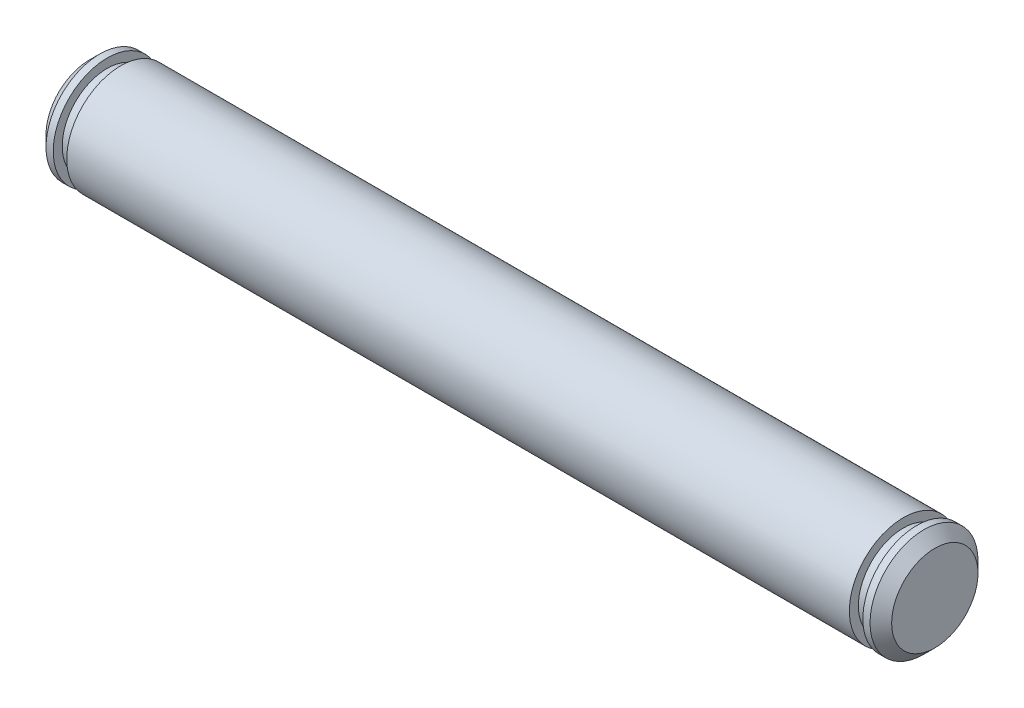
ISO-10303-21;
HEADER;
FILE_DESCRIPTION(('STEP AP214'),'2;1');
FILE_NAME('part.step','',(''),(''),'','','');
FILE_SCHEMA(('AUTOMOTIVE_DESIGN { 1 0 10303 214 1 1 1 1 }'));
ENDSEC;
DATA;
#1=APPLICATION_CONTEXT('core data for automotive mechanical design processes');
#2=APPLICATION_PROTOCOL_DEFINITION('international standard','automotive_design',2000,#1);
#3=PRODUCT_CONTEXT('',#1,'mechanical');
#4=PRODUCT('Part','Part','',(#3));
#5=PRODUCT_RELATED_PRODUCT_CATEGORY('part','',(#4));
#6=PRODUCT_DEFINITION_FORMATION('','',#4);
#7=PRODUCT_DEFINITION_CONTEXT('part definition',#1,'design');
#8=PRODUCT_DEFINITION('design','',#6,#7);
#9=PRODUCT_DEFINITION_SHAPE('','',#8);
#10=(LENGTH_UNIT() NAMED_UNIT(*) SI_UNIT(.MILLI.,.METRE.));
#11=(NAMED_UNIT(*) PLANE_ANGLE_UNIT() SI_UNIT($,.RADIAN.));
#12=(NAMED_UNIT(*) SI_UNIT($,.STERADIAN.) SOLID_ANGLE_UNIT());
#13=UNCERTAINTY_MEASURE_WITH_UNIT(LENGTH_MEASURE(1.E-05),#10,'distance_accuracy_value','');
#14=(GEOMETRIC_REPRESENTATION_CONTEXT(3) GLOBAL_UNCERTAINTY_ASSIGNED_CONTEXT((#13)) GLOBAL_UNIT_ASSIGNED_CONTEXT((#10,
#11,#12)) REPRESENTATION_CONTEXT('',''));
#15=CARTESIAN_POINT('',(0.,0.,0.));
#16=DIRECTION('',(0.,0.,1.));
#17=DIRECTION('',(1.,0.,0.));
#18=AXIS2_PLACEMENT_3D('',#15,#16,#17);
#19=CARTESIAN_POINT('',(23.5,0.,0.));
#20=DIRECTION('',(1.,0.,0.));
#21=DIRECTION('',(0.,0.,-1.));
#22=AXIS2_PLACEMENT_3D('',#19,#20,#21);
#23=PLANE('',#22);
#24=CARTESIAN_POINT('',(23.5,0.,0.));
#25=DIRECTION('',(1.,0.,0.));
#26=DIRECTION('',(0.,0.,-1.));
#27=AXIS2_PLACEMENT_3D('',#24,#25,#26);
#28=CIRCLE('',#27,2.39997655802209);
#29=CARTESIAN_POINT('',(23.5,0.,-2.39997655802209));
#30=VERTEX_POINT('',#29);
#31=EDGE_CURVE('E18',#30,#30,#28,.F.);
#32=ORIENTED_EDGE('',*,*,#31,.F.);
#33=EDGE_LOOP('',(#32));
#34=FACE_BOUND('',#33,.T.);
#35=ADVANCED_FACE('F14',(#34),#23,.T.);
#36=CARTESIAN_POINT('',(-23.5,0.,0.));
#37=DIRECTION('',(1.,0.,0.));
#38=DIRECTION('',(0.,0.,-1.));
#39=AXIS2_PLACEMENT_3D('',#36,#37,#38);
#40=PLANE('',#39);
#41=CARTESIAN_POINT('',(-23.5,0.,0.));
#42=DIRECTION('',(1.,0.,0.));
#43=DIRECTION('',(0.,0.,-1.));
#44=AXIS2_PLACEMENT_3D('',#41,#42,#43);
#45=CIRCLE('',#44,2.39997655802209);
#46=CARTESIAN_POINT('',(-23.5,0.,-2.39997655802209));
#47=VERTEX_POINT('',#46);
#48=EDGE_CURVE('E52',#47,#47,#45,.T.);
#49=ORIENTED_EDGE('',*,*,#48,.F.);
#50=EDGE_LOOP('',(#49));
#51=FACE_BOUND('',#50,.T.);
#52=ADVANCED_FACE('F62',(#51),#40,.F.);
#53=CARTESIAN_POINT('',(22.8999833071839,0.,0.));
#54=DIRECTION('',(-1.,0.,0.));
#55=DIRECTION('',(0.,0.,1.));
#56=AXIS2_PLACEMENT_3D('',#53,#54,#55);
#57=CONICAL_SURFACE('',#56,2.99998739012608,0.785393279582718);
#58=CARTESIAN_POINT('',(22.8999706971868,0.,0.));
#59=DIRECTION('',(-1.,0.,0.));
#60=DIRECTION('',(0.,0.,1.));
#61=AXIS2_PLACEMENT_3D('',#58,#59,#60);
#62=CIRCLE('',#61,3.);
#63=CARTESIAN_POINT('',(22.8999706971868,0.,3.));
#64=VERTEX_POINT('',#63);
#65=EDGE_CURVE('E50',#64,#64,#62,.T.);
#66=ORIENTED_EDGE('',*,*,#65,.F.);
#67=EDGE_LOOP('',(#66));
#68=FACE_BOUND('',#67,.T.);
#69=ORIENTED_EDGE('',*,*,#31,.T.);
#70=EDGE_LOOP('',(#69));
#71=FACE_BOUND('',#70,.T.);
#72=ADVANCED_FACE('F59',(#68,#71),#57,.T.);
#73=CARTESIAN_POINT('',(-22.8999833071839,0.,0.));
#74=DIRECTION('',(1.,0.,0.));
#75=DIRECTION('',(0.,0.,-1.));
#76=AXIS2_PLACEMENT_3D('',#73,#74,#75);
#77=CONICAL_SURFACE('',#76,2.99998739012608,0.785393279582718);
#78=CARTESIAN_POINT('',(-22.8999706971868,0.,0.));
#79=DIRECTION('',(1.,0.,0.));
#80=DIRECTION('',(0.,0.,-1.));
#81=AXIS2_PLACEMENT_3D('',#78,#79,#80);
#82=CIRCLE('',#81,3.);
#83=CARTESIAN_POINT('',(-22.8999706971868,0.,-3.));
#84=VERTEX_POINT('',#83);
#85=EDGE_CURVE('E47',#84,#84,#82,.T.);
#86=ORIENTED_EDGE('',*,*,#85,.F.);
#87=EDGE_LOOP('',(#86));
#88=FACE_BOUND('',#87,.T.);
#89=ORIENTED_EDGE('',*,*,#48,.T.);
#90=EDGE_LOOP('',(#89));
#91=FACE_BOUND('',#90,.T.);
#92=ADVANCED_FACE('F109',(#88,#91),#77,.T.);
#93=CARTESIAN_POINT('',(-23.5,0.,0.));
#94=DIRECTION('',(1.,0.,0.));
#95=DIRECTION('',(0.,0.,-1.));
#96=AXIS2_PLACEMENT_3D('',#93,#94,#95);
#97=CYLINDRICAL_SURFACE('',#96,3.);
#98=ORIENTED_EDGE('',*,*,#65,.T.);
#99=EDGE_LOOP('',(#98));
#100=FACE_BOUND('',#99,.T.);
#101=CARTESIAN_POINT('',(22.5,0.,0.));
#102=DIRECTION('',(1.,0.,0.));
#103=DIRECTION('',(0.,0.,-1.));
#104=AXIS2_PLACEMENT_3D('',#101,#102,#103);
#105=CIRCLE('',#104,3.);
#106=CARTESIAN_POINT('',(22.5,0.,-3.));
#107=VERTEX_POINT('',#106);
#108=EDGE_CURVE('E44',#107,#107,#105,.T.);
#109=ORIENTED_EDGE('',*,*,#108,.T.);
#110=EDGE_LOOP('',(#109));
#111=FACE_BOUND('',#110,.T.);
#112=ADVANCED_FACE('F105',(#100,#111),#97,.T.);
#113=CARTESIAN_POINT('',(-23.5,0.,0.));
#114=DIRECTION('',(1.,0.,0.));
#115=DIRECTION('',(0.,0.,-1.));
#116=AXIS2_PLACEMENT_3D('',#113,#114,#115);
#117=CYLINDRICAL_SURFACE('',#116,3.);
#118=ORIENTED_EDGE('',*,*,#85,.T.);
#119=EDGE_LOOP('',(#118));
#120=FACE_BOUND('',#119,.T.);
#121=CARTESIAN_POINT('',(-22.5,0.,0.));
#122=DIRECTION('',(1.,0.,0.));
#123=DIRECTION('',(0.,0.,-1.));
#124=AXIS2_PLACEMENT_3D('',#121,#122,#123);
#125=CIRCLE('',#124,3.);
#126=CARTESIAN_POINT('',(-22.5,0.,-3.));
#127=VERTEX_POINT('',#126);
#128=EDGE_CURVE('E41',#127,#127,#125,.T.);
#129=ORIENTED_EDGE('',*,*,#128,.F.);
#130=EDGE_LOOP('',(#129));
#131=FACE_BOUND('',#130,.T.);
#132=ADVANCED_FACE('F101',(#120,#131),#117,.T.);
#133=CARTESIAN_POINT('',(22.5,0.,0.));
#134=DIRECTION('',(1.,0.,0.));
#135=DIRECTION('',(0.,0.,-1.));
#136=AXIS2_PLACEMENT_3D('',#133,#134,#135);
#137=PLANE('',#136);
#138=CARTESIAN_POINT('',(22.5,0.,0.));
#139=DIRECTION('',(1.,0.,0.));
#140=DIRECTION('',(0.,0.,-1.));
#141=AXIS2_PLACEMENT_3D('',#138,#139,#140);
#142=CIRCLE('',#141,2.5);
#143=CARTESIAN_POINT('',(22.5,0.,-2.5));
#144=VERTEX_POINT('',#143);
#145=EDGE_CURVE('E38',#144,#144,#142,.F.);
#146=ORIENTED_EDGE('',*,*,#145,.F.);
#147=EDGE_LOOP('',(#146));
#148=FACE_BOUND('',#147,.T.);
#149=ORIENTED_EDGE('',*,*,#108,.F.);
#150=EDGE_LOOP('',(#149));
#151=FACE_BOUND('',#150,.T.);
#152=ADVANCED_FACE('F97',(#148,#151),#137,.F.);
#153=CARTESIAN_POINT('',(-22.5,0.,0.));
#154=DIRECTION('',(1.,0.,0.));
#155=DIRECTION('',(0.,0.,-1.));
#156=AXIS2_PLACEMENT_3D('',#153,#154,#155);
#157=PLANE('',#156);
#158=CARTESIAN_POINT('',(-22.5,0.,0.));
#159=DIRECTION('',(1.,0.,0.));
#160=DIRECTION('',(0.,0.,-1.));
#161=AXIS2_PLACEMENT_3D('',#158,#159,#160);
#162=CIRCLE('',#161,2.5);
#163=CARTESIAN_POINT('',(-22.5,0.,-2.5));
#164=VERTEX_POINT('',#163);
#165=EDGE_CURVE('E35',#164,#164,#162,.T.);
#166=ORIENTED_EDGE('',*,*,#165,.F.);
#167=EDGE_LOOP('',(#166));
#168=FACE_BOUND('',#167,.T.);
#169=ORIENTED_EDGE('',*,*,#128,.T.);
#170=EDGE_LOOP('',(#169));
#171=FACE_BOUND('',#170,.T.);
#172=ADVANCED_FACE('F93',(#168,#171),#157,.T.);
#173=CARTESIAN_POINT('',(22.5,0.,0.));
#174=DIRECTION('',(1.,0.,0.));
#175=DIRECTION('',(0.,0.,-1.));
#176=AXIS2_PLACEMENT_3D('',#173,#174,#175);
#177=CYLINDRICAL_SURFACE('',#176,2.5);
#178=CARTESIAN_POINT('',(21.75,0.,0.));
#179=DIRECTION('',(1.,0.,0.));
#180=DIRECTION('',(0.,0.,-1.));
#181=AXIS2_PLACEMENT_3D('',#178,#179,#180);
#182=CIRCLE('',#181,2.5);
#183=CARTESIAN_POINT('',(21.75,0.,-2.5));
#184=VERTEX_POINT('',#183);
#185=EDGE_CURVE('E32',#184,#184,#182,.F.);
#186=ORIENTED_EDGE('',*,*,#185,.F.);
#187=EDGE_LOOP('',(#186));
#188=FACE_BOUND('',#187,.T.);
#189=ORIENTED_EDGE('',*,*,#145,.T.);
#190=EDGE_LOOP('',(#189));
#191=FACE_BOUND('',#190,.T.);
#192=ADVANCED_FACE('F87',(#188,#191),#177,.T.);
#193=CARTESIAN_POINT('',(-22.5,0.,0.));
#194=DIRECTION('',(1.,0.,0.));
#195=DIRECTION('',(0.,0.,-1.));
#196=AXIS2_PLACEMENT_3D('',#193,#194,#195);
#197=CYLINDRICAL_SURFACE('',#196,2.5);
#198=CARTESIAN_POINT('',(-21.75,0.,0.));
#199=DIRECTION('',(1.,0.,0.));
#200=DIRECTION('',(0.,0.,-1.));
#201=AXIS2_PLACEMENT_3D('',#198,#199,#200);
#202=CIRCLE('',#201,2.5);
#203=CARTESIAN_POINT('',(-21.75,0.,-2.5));
#204=VERTEX_POINT('',#203);
#205=EDGE_CURVE('E27',#204,#204,#202,.F.);
#206=ORIENTED_EDGE('',*,*,#205,.T.);
#207=EDGE_LOOP('',(#206));
#208=FACE_BOUND('',#207,.T.);
#209=ORIENTED_EDGE('',*,*,#165,.T.);
#210=EDGE_LOOP('',(#209));
#211=FACE_BOUND('',#210,.T.);
#212=ADVANCED_FACE('F81',(#208,#211),#197,.T.);
#213=CARTESIAN_POINT('',(21.75,0.,0.));
#214=DIRECTION('',(1.,0.,0.));
#215=DIRECTION('',(0.,0.,-1.));
#216=AXIS2_PLACEMENT_3D('',#213,#214,#215);
#217=PLANE('',#216);
#218=ORIENTED_EDGE('',*,*,#185,.T.);
#219=EDGE_LOOP('',(#218));
#220=FACE_BOUND('',#219,.T.);
#221=CARTESIAN_POINT('',(21.75,0.,0.));
#222=DIRECTION('',(1.,0.,0.));
#223=DIRECTION('',(0.,0.,-1.));
#224=AXIS2_PLACEMENT_3D('',#221,#222,#223);
#225=CIRCLE('',#224,3.);
#226=CARTESIAN_POINT('',(21.75,0.,-3.));
#227=VERTEX_POINT('',#226);
#228=EDGE_CURVE('E22',#227,#227,#225,.F.);
#229=ORIENTED_EDGE('',*,*,#228,.F.);
#230=EDGE_LOOP('',(#229));
#231=FACE_BOUND('',#230,.T.);
#232=ADVANCED_FACE('F76',(#220,#231),#217,.T.);
#233=CARTESIAN_POINT('',(-21.75,0.,0.));
#234=DIRECTION('',(1.,0.,0.));
#235=DIRECTION('',(0.,0.,-1.));
#236=AXIS2_PLACEMENT_3D('',#233,#234,#235);
#237=PLANE('',#236);
#238=ORIENTED_EDGE('',*,*,#205,.F.);
#239=EDGE_LOOP('',(#238));
#240=FACE_BOUND('',#239,.T.);
#241=CARTESIAN_POINT('',(-21.75,0.,0.));
#242=DIRECTION('',(1.,0.,0.));
#243=DIRECTION('',(0.,0.,-1.));
#244=AXIS2_PLACEMENT_3D('',#241,#242,#243);
#245=CIRCLE('',#244,3.);
#246=CARTESIAN_POINT('',(-21.75,0.,-3.));
#247=VERTEX_POINT('',#246);
#248=EDGE_CURVE('E10',#247,#247,#245,.T.);
#249=ORIENTED_EDGE('',*,*,#248,.F.);
#250=EDGE_LOOP('',(#249));
#251=FACE_BOUND('',#250,.T.);
#252=ADVANCED_FACE('F71',(#240,#251),#237,.F.);
#253=CARTESIAN_POINT('',(-23.5,0.,0.));
#254=DIRECTION('',(1.,0.,0.));
#255=DIRECTION('',(0.,0.,-1.));
#256=AXIS2_PLACEMENT_3D('',#253,#254,#255);
#257=CYLINDRICAL_SURFACE('',#256,3.);
#258=ORIENTED_EDGE('',*,*,#228,.T.);
#259=EDGE_LOOP('',(#258));
#260=FACE_BOUND('',#259,.T.);
#261=ORIENTED_EDGE('',*,*,#248,.T.);
#262=EDGE_LOOP('',(#261));
#263=FACE_BOUND('',#262,.T.);
#264=ADVANCED_FACE('F16',(#260,#263),#257,.T.);
#265=CLOSED_SHELL('',(#35,#52,#72,#92,#112,#132,#152,#172,#192,#212,#232,#252,#264));
#266=MANIFOLD_SOLID_BREP('B1',#265);
#267=ADVANCED_BREP_SHAPE_REPRESENTATION('',(#18,#266),#14);
#268=SHAPE_DEFINITION_REPRESENTATION(#9,#267);
ENDSEC;
END-ISO-10303-21;
